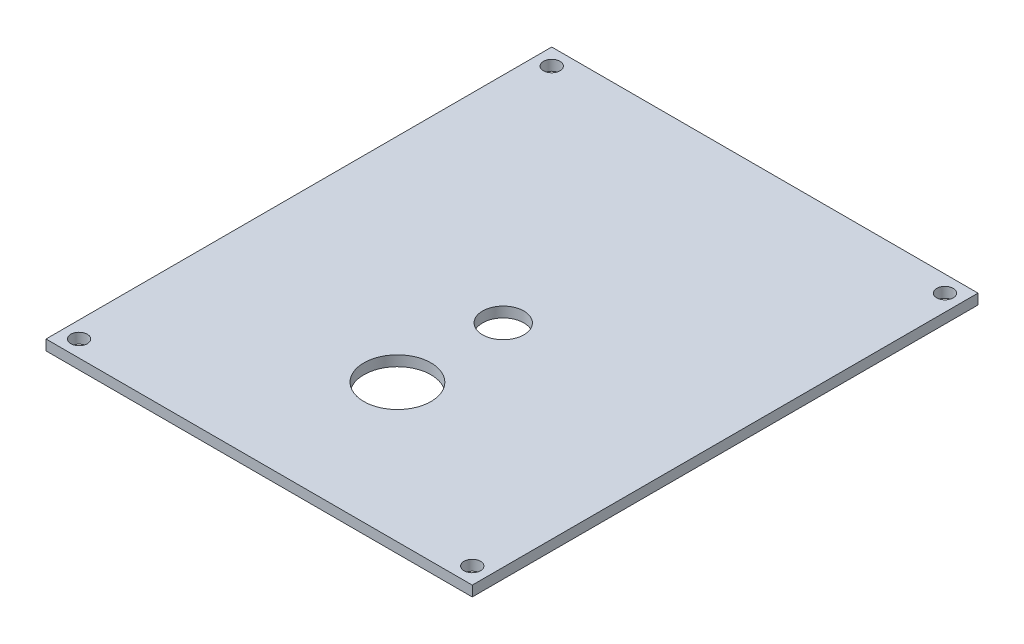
ISO-10303-21;
HEADER;
FILE_DESCRIPTION(('STEP AP214'),'2;1');
FILE_NAME('part.step','',(''),(''),'','','');
FILE_SCHEMA(('AUTOMOTIVE_DESIGN { 1 0 10303 214 1 1 1 1 }'));
ENDSEC;
DATA;
#1=APPLICATION_CONTEXT('core data for automotive mechanical design processes');
#2=APPLICATION_PROTOCOL_DEFINITION('international standard','automotive_design',2000,#1);
#3=PRODUCT_CONTEXT('',#1,'mechanical');
#4=PRODUCT('Part','Part','',(#3));
#5=PRODUCT_RELATED_PRODUCT_CATEGORY('part','',(#4));
#6=PRODUCT_DEFINITION_FORMATION('','',#4);
#7=PRODUCT_DEFINITION_CONTEXT('part definition',#1,'design');
#8=PRODUCT_DEFINITION('design','',#6,#7);
#9=PRODUCT_DEFINITION_SHAPE('','',#8);
#10=(LENGTH_UNIT() NAMED_UNIT(*) SI_UNIT(.MILLI.,.METRE.));
#11=(NAMED_UNIT(*) PLANE_ANGLE_UNIT() SI_UNIT($,.RADIAN.));
#12=(NAMED_UNIT(*) SI_UNIT($,.STERADIAN.) SOLID_ANGLE_UNIT());
#13=UNCERTAINTY_MEASURE_WITH_UNIT(LENGTH_MEASURE(1.E-05),#10,'distance_accuracy_value','');
#14=(GEOMETRIC_REPRESENTATION_CONTEXT(3) GLOBAL_UNCERTAINTY_ASSIGNED_CONTEXT((#13)) GLOBAL_UNIT_ASSIGNED_CONTEXT((#10,
#11,#12)) REPRESENTATION_CONTEXT('',''));
#15=CARTESIAN_POINT('',(0.,0.,0.));
#16=DIRECTION('',(0.,0.,1.));
#17=DIRECTION('',(1.,0.,0.));
#18=AXIS2_PLACEMENT_3D('',#15,#16,#17);
#19=CARTESIAN_POINT('',(-41.3,2.,-49.));
#20=DIRECTION('',(1.,0.,0.));
#21=DIRECTION('',(0.,0.,-1.));
#22=AXIS2_PLACEMENT_3D('',#19,#20,#21);
#23=PLANE('',#22);
#24=DIRECTION('',(0.,0.,1.));
#25=VECTOR('',#24,1.);
#26=CARTESIAN_POINT('',(-41.3,0.,-49.));
#27=LINE('',#26,#25);
#28=CARTESIAN_POINT('',(-41.3,0.,-49.));
#29=VERTEX_POINT('',#28);
#30=CARTESIAN_POINT('',(-41.3,0.,49.));
#31=VERTEX_POINT('',#30);
#32=EDGE_CURVE('E98',#29,#31,#27,.T.);
#33=ORIENTED_EDGE('',*,*,#32,.T.);
#34=DIRECTION('',(0.,-1.,0.));
#35=VECTOR('',#34,1.);
#36=CARTESIAN_POINT('',(-41.3,2.,49.));
#37=LINE('',#36,#35);
#38=CARTESIAN_POINT('',(-41.3,2.,49.));
#39=VERTEX_POINT('',#38);
#40=EDGE_CURVE('E11',#39,#31,#37,.T.);
#41=ORIENTED_EDGE('',*,*,#40,.F.);
#42=DIRECTION('',(0.,0.,1.));
#43=VECTOR('',#42,1.);
#44=CARTESIAN_POINT('',(-41.3,2.,-49.));
#45=LINE('',#44,#43);
#46=CARTESIAN_POINT('',(-41.3,2.,-49.));
#47=VERTEX_POINT('',#46);
#48=EDGE_CURVE('E85',#47,#39,#45,.T.);
#49=ORIENTED_EDGE('',*,*,#48,.F.);
#50=DIRECTION('',(0.,-1.,0.));
#51=VECTOR('',#50,1.);
#52=CARTESIAN_POINT('',(-41.3,2.,-49.));
#53=LINE('',#52,#51);
#54=EDGE_CURVE('E94',#47,#29,#53,.T.);
#55=ORIENTED_EDGE('',*,*,#54,.T.);
#56=EDGE_LOOP('',(#33,#41,#49,#55));
#57=FACE_BOUND('',#56,.T.);
#58=ADVANCED_FACE('F33',(#57),#23,.F.);
#59=CARTESIAN_POINT('',(41.3,2.,49.));
#60=DIRECTION('',(0.,0.,-1.));
#61=DIRECTION('',(-1.,0.,0.));
#62=AXIS2_PLACEMENT_3D('',#59,#60,#61);
#63=PLANE('',#62);
#64=DIRECTION('',(1.,0.,0.));
#65=VECTOR('',#64,1.);
#66=CARTESIAN_POINT('',(41.3,0.,49.));
#67=LINE('',#66,#65);
#68=CARTESIAN_POINT('',(41.3,0.,49.));
#69=VERTEX_POINT('',#68);
#70=EDGE_CURVE('E89',#31,#69,#67,.T.);
#71=ORIENTED_EDGE('',*,*,#70,.T.);
#72=DIRECTION('',(0.,-1.,0.));
#73=VECTOR('',#72,1.);
#74=CARTESIAN_POINT('',(41.3,2.,49.));
#75=LINE('',#74,#73);
#76=CARTESIAN_POINT('',(41.3,2.,49.));
#77=VERTEX_POINT('',#76);
#78=EDGE_CURVE('E42',#77,#69,#75,.T.);
#79=ORIENTED_EDGE('',*,*,#78,.F.);
#80=DIRECTION('',(1.,0.,0.));
#81=VECTOR('',#80,1.);
#82=CARTESIAN_POINT('',(41.3,2.,49.));
#83=LINE('',#82,#81);
#84=EDGE_CURVE('E80',#39,#77,#83,.T.);
#85=ORIENTED_EDGE('',*,*,#84,.F.);
#86=ORIENTED_EDGE('',*,*,#40,.T.);
#87=EDGE_LOOP('',(#71,#79,#85,#86));
#88=FACE_BOUND('',#87,.T.);
#89=ADVANCED_FACE('F88',(#88),#63,.F.);
#90=CARTESIAN_POINT('',(41.3,2.,-49.));
#91=DIRECTION('',(-1.,0.,0.));
#92=DIRECTION('',(0.,0.,1.));
#93=AXIS2_PLACEMENT_3D('',#90,#91,#92);
#94=PLANE('',#93);
#95=DIRECTION('',(0.,0.,-1.));
#96=VECTOR('',#95,1.);
#97=CARTESIAN_POINT('',(41.3,0.,-49.));
#98=LINE('',#97,#96);
#99=CARTESIAN_POINT('',(41.3,0.,-49.));
#100=VERTEX_POINT('',#99);
#101=EDGE_CURVE('E67',#69,#100,#98,.T.);
#102=ORIENTED_EDGE('',*,*,#101,.T.);
#103=DIRECTION('',(0.,-1.,0.));
#104=VECTOR('',#103,1.);
#105=CARTESIAN_POINT('',(41.3,2.,-49.));
#106=LINE('',#105,#104);
#107=CARTESIAN_POINT('',(41.3,2.,-49.));
#108=VERTEX_POINT('',#107);
#109=EDGE_CURVE('E90',#108,#100,#106,.T.);
#110=ORIENTED_EDGE('',*,*,#109,.F.);
#111=DIRECTION('',(0.,0.,-1.));
#112=VECTOR('',#111,1.);
#113=CARTESIAN_POINT('',(41.3,2.,-49.));
#114=LINE('',#113,#112);
#115=EDGE_CURVE('E83',#77,#108,#114,.T.);
#116=ORIENTED_EDGE('',*,*,#115,.F.);
#117=ORIENTED_EDGE('',*,*,#78,.T.);
#118=EDGE_LOOP('',(#102,#110,#116,#117));
#119=FACE_BOUND('',#118,.T.);
#120=ADVANCED_FACE('F92',(#119),#94,.F.);
#121=CARTESIAN_POINT('',(41.3,2.,-49.));
#122=DIRECTION('',(0.,0.,1.));
#123=DIRECTION('',(1.,0.,0.));
#124=AXIS2_PLACEMENT_3D('',#121,#122,#123);
#125=PLANE('',#124);
#126=DIRECTION('',(-1.,0.,0.));
#127=VECTOR('',#126,1.);
#128=CARTESIAN_POINT('',(41.3,0.,-49.));
#129=LINE('',#128,#127);
#130=EDGE_CURVE('E73',#100,#29,#129,.T.);
#131=ORIENTED_EDGE('',*,*,#130,.T.);
#132=ORIENTED_EDGE('',*,*,#54,.F.);
#133=DIRECTION('',(-1.,0.,0.));
#134=VECTOR('',#133,1.);
#135=CARTESIAN_POINT('',(41.3,2.,-49.));
#136=LINE('',#135,#134);
#137=EDGE_CURVE('E50',#108,#47,#136,.T.);
#138=ORIENTED_EDGE('',*,*,#137,.F.);
#139=ORIENTED_EDGE('',*,*,#109,.T.);
#140=EDGE_LOOP('',(#131,#132,#138,#139));
#141=FACE_BOUND('',#140,.T.);
#142=ADVANCED_FACE('F106',(#141),#125,.F.);
#143=CARTESIAN_POINT('',(0.,2.,0.));
#144=DIRECTION('',(0.,-1.,0.));
#145=DIRECTION('',(0.,0.,-1.));
#146=AXIS2_PLACEMENT_3D('',#143,#144,#145);
#147=PLANE('',#146);
#148=CARTESIAN_POINT('',(0.300000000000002,2.,1.99999999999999));
#149=DIRECTION('',(0.,1.,0.));
#150=DIRECTION('',(0.,0.,1.));
#151=AXIS2_PLACEMENT_3D('',#148,#149,#150);
#152=CIRCLE('',#151,4.);
#153=CARTESIAN_POINT('',(0.300000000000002,2.,6.));
#154=VERTEX_POINT('',#153);
#155=EDGE_CURVE('E141',#154,#154,#152,.T.);
#156=ORIENTED_EDGE('',*,*,#155,.F.);
#157=EDGE_LOOP('',(#156));
#158=FACE_BOUND('',#157,.T.);
#159=CARTESIAN_POINT('',(0.,2.,22.2));
#160=DIRECTION('',(0.,1.,0.));
#161=DIRECTION('',(0.,0.,1.));
#162=AXIS2_PLACEMENT_3D('',#159,#160,#161);
#163=CIRCLE('',#162,6.5);
#164=CARTESIAN_POINT('',(0.,2.,28.7));
#165=VERTEX_POINT('',#164);
#166=EDGE_CURVE('E136',#165,#165,#163,.T.);
#167=ORIENTED_EDGE('',*,*,#166,.F.);
#168=EDGE_LOOP('',(#167));
#169=FACE_BOUND('',#168,.T.);
#170=CARTESIAN_POINT('',(-38.1,2.,-45.8));
#171=DIRECTION('',(0.,1.,0.));
#172=DIRECTION('',(0.,0.,1.));
#173=AXIS2_PLACEMENT_3D('',#170,#171,#172);
#174=CIRCLE('',#173,1.59999999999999);
#175=CARTESIAN_POINT('',(-38.1,2.,-44.2));
#176=VERTEX_POINT('',#175);
#177=EDGE_CURVE('E132',#176,#176,#174,.T.);
#178=ORIENTED_EDGE('',*,*,#177,.F.);
#179=EDGE_LOOP('',(#178));
#180=FACE_BOUND('',#179,.T.);
#181=CARTESIAN_POINT('',(38.1,2.,-45.8));
#182=DIRECTION('',(0.,1.,0.));
#183=DIRECTION('',(0.,0.,1.));
#184=AXIS2_PLACEMENT_3D('',#181,#182,#183);
#185=CIRCLE('',#184,1.59999999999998);
#186=CARTESIAN_POINT('',(38.1,2.,-44.2));
#187=VERTEX_POINT('',#186);
#188=EDGE_CURVE('E126',#187,#187,#185,.T.);
#189=ORIENTED_EDGE('',*,*,#188,.F.);
#190=EDGE_LOOP('',(#189));
#191=FACE_BOUND('',#190,.T.);
#192=CARTESIAN_POINT('',(38.1,2.,45.8));
#193=DIRECTION('',(0.,1.,0.));
#194=DIRECTION('',(0.,0.,1.));
#195=AXIS2_PLACEMENT_3D('',#192,#193,#194);
#196=CIRCLE('',#195,1.59999999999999);
#197=CARTESIAN_POINT('',(38.1,2.,47.4));
#198=VERTEX_POINT('',#197);
#199=EDGE_CURVE('E120',#198,#198,#196,.T.);
#200=ORIENTED_EDGE('',*,*,#199,.F.);
#201=EDGE_LOOP('',(#200));
#202=FACE_BOUND('',#201,.T.);
#203=CARTESIAN_POINT('',(-38.1,2.,45.8));
#204=DIRECTION('',(0.,1.,0.));
#205=DIRECTION('',(0.,0.,1.));
#206=AXIS2_PLACEMENT_3D('',#203,#204,#205);
#207=CIRCLE('',#206,1.59999999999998);
#208=CARTESIAN_POINT('',(-38.1,2.,47.4));
#209=VERTEX_POINT('',#208);
#210=EDGE_CURVE('E114',#209,#209,#207,.T.);
#211=ORIENTED_EDGE('',*,*,#210,.F.);
#212=EDGE_LOOP('',(#211));
#213=FACE_BOUND('',#212,.T.);
#214=ORIENTED_EDGE('',*,*,#48,.T.);
#215=ORIENTED_EDGE('',*,*,#84,.T.);
#216=ORIENTED_EDGE('',*,*,#115,.T.);
#217=ORIENTED_EDGE('',*,*,#137,.T.);
#218=EDGE_LOOP('',(#214,#215,#216,#217));
#219=FACE_BOUND('',#218,.T.);
#220=ADVANCED_FACE('F81',(#158,#169,#180,#191,#202,#213,#219),#147,.F.);
#221=CARTESIAN_POINT('',(0.,0.,0.));
#222=DIRECTION('',(0.,-1.,0.));
#223=DIRECTION('',(0.,0.,-1.));
#224=AXIS2_PLACEMENT_3D('',#221,#222,#223);
#225=PLANE('',#224);
#226=CARTESIAN_POINT('',(0.300000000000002,0.,1.99999999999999));
#227=DIRECTION('',(0.,-1.,0.));
#228=DIRECTION('',(0.,0.,-1.));
#229=AXIS2_PLACEMENT_3D('',#226,#227,#228);
#230=CIRCLE('',#229,4.);
#231=CARTESIAN_POINT('',(0.300000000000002,0.,-2.00000000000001));
#232=VERTEX_POINT('',#231);
#233=EDGE_CURVE('E36',#232,#232,#230,.T.);
#234=ORIENTED_EDGE('',*,*,#233,.F.);
#235=EDGE_LOOP('',(#234));
#236=FACE_BOUND('',#235,.T.);
#237=CARTESIAN_POINT('',(0.,0.,22.2));
#238=DIRECTION('',(0.,1.,0.));
#239=DIRECTION('',(0.,0.,1.));
#240=AXIS2_PLACEMENT_3D('',#237,#238,#239);
#241=CIRCLE('',#240,6.5);
#242=CARTESIAN_POINT('',(0.,0.,28.7));
#243=VERTEX_POINT('',#242);
#244=EDGE_CURVE('E135',#243,#243,#241,.T.);
#245=ORIENTED_EDGE('',*,*,#244,.T.);
#246=EDGE_LOOP('',(#245));
#247=FACE_BOUND('',#246,.T.);
#248=CARTESIAN_POINT('',(-38.1,0.,-45.8));
#249=DIRECTION('',(0.,1.,0.));
#250=DIRECTION('',(0.,0.,1.));
#251=AXIS2_PLACEMENT_3D('',#248,#249,#250);
#252=CIRCLE('',#251,1.59999999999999);
#253=CARTESIAN_POINT('',(-38.1,0.,-44.2));
#254=VERTEX_POINT('',#253);
#255=EDGE_CURVE('E129',#254,#254,#252,.T.);
#256=ORIENTED_EDGE('',*,*,#255,.T.);
#257=EDGE_LOOP('',(#256));
#258=FACE_BOUND('',#257,.T.);
#259=CARTESIAN_POINT('',(38.1,0.,-45.8));
#260=DIRECTION('',(0.,1.,0.));
#261=DIRECTION('',(0.,0.,1.));
#262=AXIS2_PLACEMENT_3D('',#259,#260,#261);
#263=CIRCLE('',#262,1.59999999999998);
#264=CARTESIAN_POINT('',(38.1,0.,-44.2));
#265=VERTEX_POINT('',#264);
#266=EDGE_CURVE('E123',#265,#265,#263,.T.);
#267=ORIENTED_EDGE('',*,*,#266,.T.);
#268=EDGE_LOOP('',(#267));
#269=FACE_BOUND('',#268,.T.);
#270=CARTESIAN_POINT('',(38.1,0.,45.8));
#271=DIRECTION('',(0.,1.,0.));
#272=DIRECTION('',(0.,0.,1.));
#273=AXIS2_PLACEMENT_3D('',#270,#271,#272);
#274=CIRCLE('',#273,1.59999999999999);
#275=CARTESIAN_POINT('',(38.1,0.,47.4));
#276=VERTEX_POINT('',#275);
#277=EDGE_CURVE('E117',#276,#276,#274,.T.);
#278=ORIENTED_EDGE('',*,*,#277,.T.);
#279=EDGE_LOOP('',(#278));
#280=FACE_BOUND('',#279,.T.);
#281=CARTESIAN_POINT('',(-38.1,0.,45.8));
#282=DIRECTION('',(0.,1.,0.));
#283=DIRECTION('',(0.,0.,1.));
#284=AXIS2_PLACEMENT_3D('',#281,#282,#283);
#285=CIRCLE('',#284,1.59999999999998);
#286=CARTESIAN_POINT('',(-38.1,0.,47.4));
#287=VERTEX_POINT('',#286);
#288=EDGE_CURVE('E101',#287,#287,#285,.T.);
#289=ORIENTED_EDGE('',*,*,#288,.T.);
#290=EDGE_LOOP('',(#289));
#291=FACE_BOUND('',#290,.T.);
#292=ORIENTED_EDGE('',*,*,#32,.F.);
#293=ORIENTED_EDGE('',*,*,#130,.F.);
#294=ORIENTED_EDGE('',*,*,#101,.F.);
#295=ORIENTED_EDGE('',*,*,#70,.F.);
#296=EDGE_LOOP('',(#292,#293,#294,#295));
#297=FACE_BOUND('',#296,.T.);
#298=ADVANCED_FACE('F109',(#236,#247,#258,#269,#280,#291,#297),#225,.T.);
#299=CARTESIAN_POINT('',(-38.1,2.,45.8));
#300=DIRECTION('',(0.,1.,0.));
#301=DIRECTION('',(0.,0.,1.));
#302=AXIS2_PLACEMENT_3D('',#299,#300,#301);
#303=CYLINDRICAL_SURFACE('',#302,1.59999999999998);
#304=ORIENTED_EDGE('',*,*,#288,.F.);
#305=EDGE_LOOP('',(#304));
#306=FACE_BOUND('',#305,.T.);
#307=ORIENTED_EDGE('',*,*,#210,.T.);
#308=EDGE_LOOP('',(#307));
#309=FACE_BOUND('',#308,.T.);
#310=ADVANCED_FACE('F152',(#306,#309),#303,.F.);
#311=CARTESIAN_POINT('',(38.1,2.,45.8));
#312=DIRECTION('',(0.,1.,0.));
#313=DIRECTION('',(0.,0.,1.));
#314=AXIS2_PLACEMENT_3D('',#311,#312,#313);
#315=CYLINDRICAL_SURFACE('',#314,1.59999999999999);
#316=ORIENTED_EDGE('',*,*,#277,.F.);
#317=EDGE_LOOP('',(#316));
#318=FACE_BOUND('',#317,.T.);
#319=ORIENTED_EDGE('',*,*,#199,.T.);
#320=EDGE_LOOP('',(#319));
#321=FACE_BOUND('',#320,.T.);
#322=ADVANCED_FACE('F166',(#318,#321),#315,.F.);
#323=CARTESIAN_POINT('',(38.1,2.,-45.8));
#324=DIRECTION('',(0.,1.,0.));
#325=DIRECTION('',(0.,0.,1.));
#326=AXIS2_PLACEMENT_3D('',#323,#324,#325);
#327=CYLINDRICAL_SURFACE('',#326,1.59999999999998);
#328=ORIENTED_EDGE('',*,*,#266,.F.);
#329=EDGE_LOOP('',(#328));
#330=FACE_BOUND('',#329,.T.);
#331=ORIENTED_EDGE('',*,*,#188,.T.);
#332=EDGE_LOOP('',(#331));
#333=FACE_BOUND('',#332,.T.);
#334=ADVANCED_FACE('F214',(#330,#333),#327,.F.);
#335=CARTESIAN_POINT('',(-38.1,2.,-45.8));
#336=DIRECTION('',(0.,1.,0.));
#337=DIRECTION('',(0.,0.,1.));
#338=AXIS2_PLACEMENT_3D('',#335,#336,#337);
#339=CYLINDRICAL_SURFACE('',#338,1.59999999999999);
#340=ORIENTED_EDGE('',*,*,#255,.F.);
#341=EDGE_LOOP('',(#340));
#342=FACE_BOUND('',#341,.T.);
#343=ORIENTED_EDGE('',*,*,#177,.T.);
#344=EDGE_LOOP('',(#343));
#345=FACE_BOUND('',#344,.T.);
#346=ADVANCED_FACE('F222',(#342,#345),#339,.F.);
#347=CARTESIAN_POINT('',(0.,0.,22.2));
#348=DIRECTION('',(0.,1.,0.));
#349=DIRECTION('',(0.,0.,1.));
#350=AXIS2_PLACEMENT_3D('',#347,#348,#349);
#351=CYLINDRICAL_SURFACE('',#350,6.5);
#352=ORIENTED_EDGE('',*,*,#244,.F.);
#353=EDGE_LOOP('',(#352));
#354=FACE_BOUND('',#353,.T.);
#355=ORIENTED_EDGE('',*,*,#166,.T.);
#356=EDGE_LOOP('',(#355));
#357=FACE_BOUND('',#356,.T.);
#358=ADVANCED_FACE('F230',(#354,#357),#351,.F.);
#359=CARTESIAN_POINT('',(0.300000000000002,-8.,1.99999999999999));
#360=DIRECTION('',(0.,1.,0.));
#361=DIRECTION('',(0.,0.,1.));
#362=AXIS2_PLACEMENT_3D('',#359,#360,#361);
#363=CYLINDRICAL_SURFACE('',#362,4.);
#364=ORIENTED_EDGE('',*,*,#233,.T.);
#365=EDGE_LOOP('',(#364));
#366=FACE_BOUND('',#365,.T.);
#367=ORIENTED_EDGE('',*,*,#155,.T.);
#368=EDGE_LOOP('',(#367));
#369=FACE_BOUND('',#368,.T.);
#370=ADVANCED_FACE('F148',(#366,#369),#363,.F.);
#371=CLOSED_SHELL('',(#58,#89,#120,#142,#220,#298,#310,#322,#334,#346,#358,#370));
#372=MANIFOLD_SOLID_BREP('B2',#371);
#373=ADVANCED_BREP_SHAPE_REPRESENTATION('',(#18,#372),#14);
#374=SHAPE_DEFINITION_REPRESENTATION(#9,#373);
ENDSEC;
END-ISO-10303-21;
